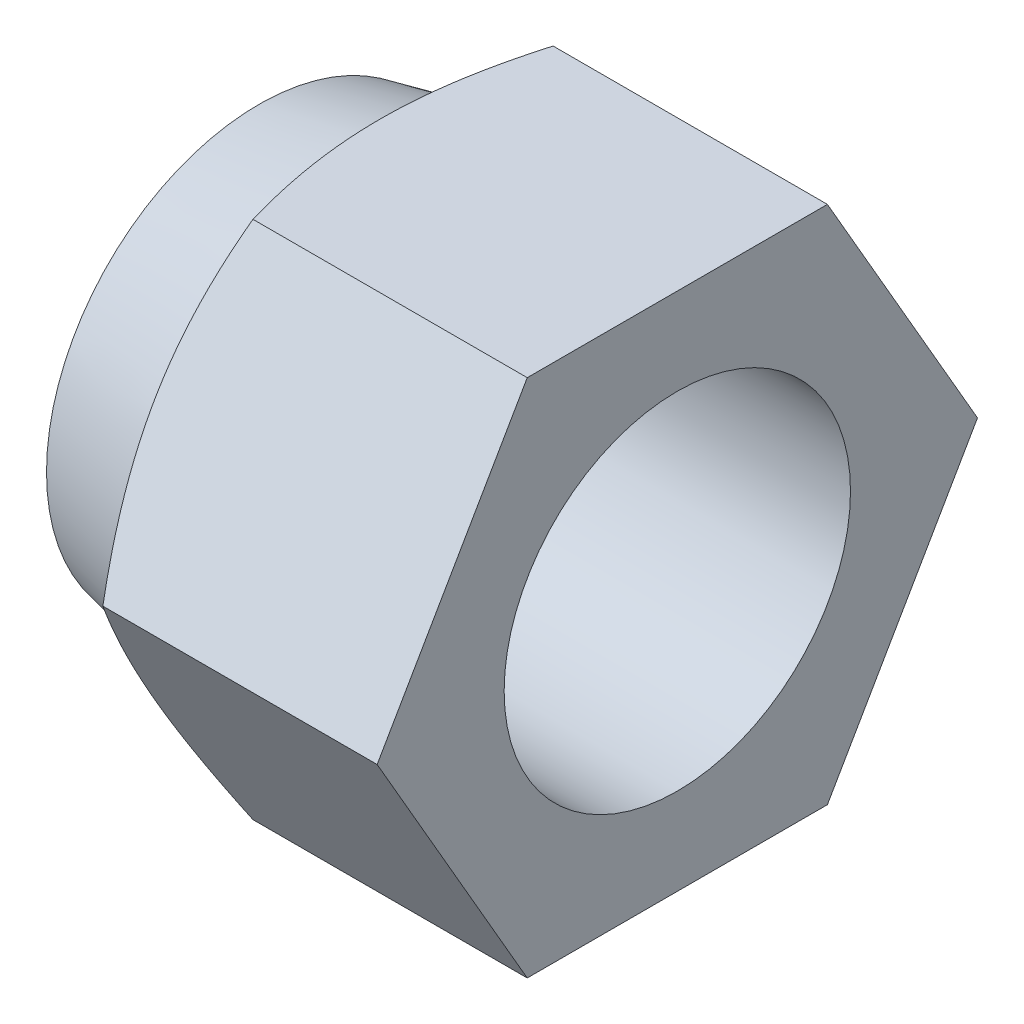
ISO-10303-21;
HEADER;
FILE_DESCRIPTION(('STEP AP214'),'2;1');
FILE_NAME('part.step','',(''),(''),'','','');
FILE_SCHEMA(('AUTOMOTIVE_DESIGN { 1 0 10303 214 1 1 1 1 }'));
ENDSEC;
DATA;
#1=APPLICATION_CONTEXT('core data for automotive mechanical design processes');
#2=APPLICATION_PROTOCOL_DEFINITION('international standard','automotive_design',2000,#1);
#3=PRODUCT_CONTEXT('',#1,'mechanical');
#4=PRODUCT('Part','Part','',(#3));
#5=PRODUCT_RELATED_PRODUCT_CATEGORY('part','',(#4));
#6=PRODUCT_DEFINITION_FORMATION('','',#4);
#7=PRODUCT_DEFINITION_CONTEXT('part definition',#1,'design');
#8=PRODUCT_DEFINITION('design','',#6,#7);
#9=PRODUCT_DEFINITION_SHAPE('','',#8);
#10=(LENGTH_UNIT() NAMED_UNIT(*) SI_UNIT(.MILLI.,.METRE.));
#11=(NAMED_UNIT(*) PLANE_ANGLE_UNIT() SI_UNIT($,.RADIAN.));
#12=(NAMED_UNIT(*) SI_UNIT($,.STERADIAN.) SOLID_ANGLE_UNIT());
#13=UNCERTAINTY_MEASURE_WITH_UNIT(LENGTH_MEASURE(1.E-05),#10,'distance_accuracy_value','');
#14=(GEOMETRIC_REPRESENTATION_CONTEXT(3) GLOBAL_UNCERTAINTY_ASSIGNED_CONTEXT((#13)) GLOBAL_UNIT_ASSIGNED_CONTEXT((#10,
#11,#12)) REPRESENTATION_CONTEXT('',''));
#15=CARTESIAN_POINT('',(0.,0.,0.));
#16=DIRECTION('',(0.,0.,1.));
#17=DIRECTION('',(1.,0.,0.));
#18=AXIS2_PLACEMENT_3D('',#15,#16,#17);
#19=CARTESIAN_POINT('',(-7.5438,0.,0.));
#20=DIRECTION('',(1.,0.,0.));
#21=DIRECTION('',(0.,0.,-1.));
#22=AXIS2_PLACEMENT_3D('',#19,#20,#21);
#23=CONICAL_SURFACE('',#22,8.255,1.0471975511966);
#24=CARTESIAN_POINT('',(-8.5598,0.,0.));
#25=DIRECTION('',(-1.,0.,0.));
#26=DIRECTION('',(0.,0.,1.));
#27=AXIS2_PLACEMENT_3D('',#24,#25,#26);
#28=CIRCLE('',#27,6.49523637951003);
#29=CARTESIAN_POINT('',(-8.5598,0.,6.49523637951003));
#30=VERTEX_POINT('',#29);
#31=EDGE_CURVE('E482',#30,#30,#28,.T.);
#32=ORIENTED_EDGE('',*,*,#31,.F.);
#33=EDGE_LOOP('',(#32));
#34=FACE_BOUND('',#33,.T.);
#35=CARTESIAN_POINT('',(-4.78656867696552,7.14903970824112,-10.8944690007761));
#36=CARTESIAN_POINT('',(-4.93784161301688,7.14903970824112,-10.5809890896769));
#37=CARTESIAN_POINT('',(-5.08759466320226,7.14903970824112,-10.2667620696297));
#38=CARTESIAN_POINT('',(-5.38319123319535,7.14903970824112,-9.63640957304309));
#39=CARTESIAN_POINT('',(-5.52903406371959,7.14903970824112,-9.32028377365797));
#40=CARTESIAN_POINT('',(-5.81672020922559,7.14903970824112,-8.68399579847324));
#41=CARTESIAN_POINT('',(-5.9585353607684,7.14903970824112,-8.36382084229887));
#42=CARTESIAN_POINT('',(-6.23599857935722,7.14903970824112,-7.72082002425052));
#43=CARTESIAN_POINT('',(-6.37164697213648,7.14903970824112,-7.39799430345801));
#44=CARTESIAN_POINT('',(-6.63664516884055,7.14903970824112,-6.74541517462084));
#45=CARTESIAN_POINT('',(-6.765904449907,7.14903970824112,-6.41562479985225));
#46=CARTESIAN_POINT('',(-7.01416839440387,7.14903970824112,-5.7521365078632));
#47=CARTESIAN_POINT('',(-7.13317191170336,7.14903970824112,-5.41843815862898));
#48=CARTESIAN_POINT('',(-7.35768798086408,7.14903970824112,-4.74730192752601));
#49=CARTESIAN_POINT('',(-7.46322967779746,7.14903970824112,-4.4098739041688));
#50=CARTESIAN_POINT('',(-7.65736259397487,7.14903970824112,-3.73023580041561));
#51=CARTESIAN_POINT('',(-7.74595922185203,7.14903970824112,-3.38802728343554));
#52=CARTESIAN_POINT('',(-7.90186579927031,7.14903970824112,-2.69851637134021));
#53=CARTESIAN_POINT('',(-7.96916730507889,7.14903970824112,-2.35121201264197));
#54=CARTESIAN_POINT('',(-8.05074860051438,7.14903970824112,-1.82724447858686));
#55=CARTESIAN_POINT('',(-8.07471561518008,7.14903970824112,-1.65206522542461));
#56=CARTESIAN_POINT('',(-8.1157203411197,7.14903970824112,-1.30090312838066));
#57=CARTESIAN_POINT('',(-8.13275870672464,7.14903970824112,-1.12492036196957));
#58=CARTESIAN_POINT('',(-8.15945000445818,7.14903970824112,-0.77347593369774));
#59=CARTESIAN_POINT('',(-8.16914746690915,7.14903970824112,-0.598017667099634));
#60=CARTESIAN_POINT('',(-8.1811065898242,7.14903970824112,-0.246848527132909));
#61=CARTESIAN_POINT('',(-8.1833683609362,7.14903970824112,-0.0711376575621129));
#62=CARTESIAN_POINT('',(-8.18040242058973,7.14903970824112,0.280173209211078));
#63=CARTESIAN_POINT('',(-8.17517676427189,7.14903970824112,0.455773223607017));
#64=CARTESIAN_POINT('',(-8.15736437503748,7.14903970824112,0.806602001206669));
#65=CARTESIAN_POINT('',(-8.14477724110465,7.14903970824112,0.981830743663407));
#66=CARTESIAN_POINT('',(-8.10546401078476,7.14903970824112,1.40809367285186));
#67=CARTESIAN_POINT('',(-8.07496272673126,7.14903970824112,1.65878631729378));
#68=CARTESIAN_POINT('',(-8.00060359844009,7.14903970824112,2.15817235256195));
#69=CARTESIAN_POINT('',(-7.95674372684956,7.14903970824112,2.40686543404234));
#70=CARTESIAN_POINT('',(-7.80733010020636,7.14903970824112,3.15039666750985));
#71=CARTESIAN_POINT('',(-7.68404370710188,7.14903970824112,3.64171081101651));
#72=CARTESIAN_POINT('',(-7.47190643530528,7.14903970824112,4.37653162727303));
#73=CARTESIAN_POINT('',(-7.39563921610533,7.14903970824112,4.62388853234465));
#74=CARTESIAN_POINT('',(-7.23560965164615,7.14903970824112,5.1162127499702));
#75=CARTESIAN_POINT('',(-7.15184663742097,7.14903970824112,5.3611798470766));
#76=CARTESIAN_POINT('',(-6.97861204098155,7.14903970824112,5.84750046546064));
#77=CARTESIAN_POINT('',(-6.88917550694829,7.14903970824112,6.08886659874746));
#78=CARTESIAN_POINT('',(-6.70519359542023,7.14903970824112,6.56955260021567));
#79=CARTESIAN_POINT('',(-6.61064998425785,7.14903970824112,6.80887314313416));
#80=CARTESIAN_POINT('',(-6.51403257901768,7.14903970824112,7.04733366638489));
#81=B_SPLINE_CURVE_WITH_KNOTS('',3,(#35,#36,#37,#38,#39,#40,#41,#42,#43,#44,#45,#46,#47,#48,#49,
#50,#51,#52,#53,#54,#55,#56,#57,#58,#59,#60,#61,#62,#63,#64,#65,#66,#67,#68,#69,#70,#71,#72,#73,
#74,#75,#76,#77,#78,#79,#80),.UNSPECIFIED.,.F.,.F.,(4,2,2,2,2,2,2,2,2,2,2,2,2,2,2,2,2,2,2,2,2,2,
4),(0.,1.04422615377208,2.08863518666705,3.13911281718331,4.18953489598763,5.25205350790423,
6.31469070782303,7.37498675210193,8.43494379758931,9.49532060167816,10.0256385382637,
10.5559063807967,11.0829312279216,11.6099482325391,12.1368206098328,12.663721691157,
13.4209143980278,14.1782220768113,15.695768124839,16.4722523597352,17.2488059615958,
18.0209579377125,18.7928445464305),.UNSPECIFIED.);
#82=CARTESIAN_POINT('',(-7.54379999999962,7.14903970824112,-4.12750000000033));
#83=VERTEX_POINT('',#82);
#84=CARTESIAN_POINT('',(-7.5438,7.14903970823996,4.127500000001));
#85=VERTEX_POINT('',#84);
#86=EDGE_CURVE('E12',#83,#85,#81,.T.);
#87=ORIENTED_EDGE('',*,*,#86,.F.);
#88=CARTESIAN_POINT('',(-7.54373333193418,-0.00019999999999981,-8.2551154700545));
#89=CARTESIAN_POINT('',(-7.59610673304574,0.156943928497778,-8.1643883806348));
#90=CARTESIAN_POINT('',(-7.64610322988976,0.314673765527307,-8.07332301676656));
#91=CARTESIAN_POINT('',(-7.74068776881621,0.631414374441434,-7.8904527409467));
#92=CARTESIAN_POINT('',(-7.78527347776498,0.790425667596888,-7.79864752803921));
#93=CARTESIAN_POINT('',(-7.91003927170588,1.27000550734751,-7.52176197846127));
#94=CARTESIAN_POINT('',(-7.98100462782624,1.5924671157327,-7.33558868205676));
#95=CARTESIAN_POINT('',(-8.0642198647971,2.07502504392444,-7.05698373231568));
#96=CARTESIAN_POINT('',(-8.08792547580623,2.23367953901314,-6.96538451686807));
#97=CARTESIAN_POINT('',(-8.12767632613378,2.5517054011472,-6.78177219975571));
#98=CARTESIAN_POINT('',(-8.14372224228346,2.71107670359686,-6.68975913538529));
#99=CARTESIAN_POINT('',(-8.16774476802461,3.03009609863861,-6.50557320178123));
#100=CARTESIAN_POINT('',(-8.17573053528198,3.1897436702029,-6.41340063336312));
#101=CARTESIAN_POINT('',(-8.18347009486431,3.50917746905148,-6.22897544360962));
#102=CARTESIAN_POINT('',(-8.18322414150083,3.66896369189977,-6.13672282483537));
#103=CARTESIAN_POINT('',(-8.17123534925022,4.10672450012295,-5.88398150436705));
#104=CARTESIAN_POINT('',(-8.15110974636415,4.38455578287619,-5.72357553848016));
#105=CARTESIAN_POINT('',(-8.08729164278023,4.93837301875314,-5.40382900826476));
#106=CARTESIAN_POINT('',(-8.04357733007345,5.21435702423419,-5.24448956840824));
#107=CARTESIAN_POINT('',(-7.93430437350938,5.76928878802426,-4.92409956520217));
#108=CARTESIAN_POINT('',(-7.86828275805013,6.04816652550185,-4.76308942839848));
#109=CARTESIAN_POINT('',(-7.71844038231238,6.6017631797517,-4.44347025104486));
#110=CARTESIAN_POINT('',(-7.6346548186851,6.87648918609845,-4.28485711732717));
#111=CARTESIAN_POINT('',(-7.54373333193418,7.14923970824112,-4.12738452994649));
#112=B_SPLINE_CURVE_WITH_KNOTS('',3,(#88,#89,#90,#91,#92,#93,#94,#95,#96,#97,#98,#99,#100,#101,
#102,#103,#104,#105,#106,#107,#108,#109,#110,#111),.UNSPECIFIED.,.F.,.F.,(4,2,2,2,2,2,2,2,2,2,2,
4),(0.,0.566538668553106,1.13332076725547,2.26924008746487,2.82328813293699,3.37728721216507,
3.93065614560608,4.48400798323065,5.44732494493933,6.41153419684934,7.3971281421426,
8.3807872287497),.UNSPECIFIED.);
#113=CARTESIAN_POINT('',(-7.54379999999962,0.,-8.25500000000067));
#114=VERTEX_POINT('',#113);
#115=EDGE_CURVE('E397',#114,#83,#112,.T.);
#116=ORIENTED_EDGE('',*,*,#115,.F.);
#117=CARTESIAN_POINT('',(-7.54373333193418,-7.14923970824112,-4.12738452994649));
#118=CARTESIAN_POINT('',(-7.59610673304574,-6.99209577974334,-4.2181116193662));
#119=CARTESIAN_POINT('',(-7.64610322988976,-6.83436594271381,-4.30917698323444));
#120=CARTESIAN_POINT('',(-7.74068776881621,-6.51762533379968,-4.49204725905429));
#121=CARTESIAN_POINT('',(-7.78527347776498,-6.35861404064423,-4.58385247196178));
#122=CARTESIAN_POINT('',(-7.91003927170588,-5.8790342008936,-4.86073802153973));
#123=CARTESIAN_POINT('',(-7.98100462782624,-5.55657259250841,-5.04691131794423));
#124=CARTESIAN_POINT('',(-8.0642198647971,-5.07401466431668,-5.32551626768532));
#125=CARTESIAN_POINT('',(-8.08792547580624,-4.91536016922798,-5.41711548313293));
#126=CARTESIAN_POINT('',(-8.12767632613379,-4.59733430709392,-5.60072780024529));
#127=CARTESIAN_POINT('',(-8.14372224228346,-4.43796300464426,-5.6927408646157));
#128=CARTESIAN_POINT('',(-8.16774476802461,-4.1189436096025,-5.87692679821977));
#129=CARTESIAN_POINT('',(-8.17573053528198,-3.95929603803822,-5.96909936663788));
#130=CARTESIAN_POINT('',(-8.18347009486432,-3.63986223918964,-6.15352455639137));
#131=CARTESIAN_POINT('',(-8.18322414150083,-3.48007601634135,-6.24577717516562));
#132=CARTESIAN_POINT('',(-8.17123534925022,-3.04231520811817,-6.49851849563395));
#133=CARTESIAN_POINT('',(-8.15110974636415,-2.76448392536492,-6.65892446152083));
#134=CARTESIAN_POINT('',(-8.08729164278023,-2.21066668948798,-6.97867099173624));
#135=CARTESIAN_POINT('',(-8.04357733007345,-1.93468268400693,-7.13801043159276));
#136=CARTESIAN_POINT('',(-7.93430437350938,-1.37975092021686,-7.45840043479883));
#137=CARTESIAN_POINT('',(-7.86828275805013,-1.10087318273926,-7.61941057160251));
#138=CARTESIAN_POINT('',(-7.71844038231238,-0.547276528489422,-7.93902974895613));
#139=CARTESIAN_POINT('',(-7.6346548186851,-0.272550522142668,-8.09764288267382));
#140=CARTESIAN_POINT('',(-7.54373333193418,0.000199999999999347,-8.2551154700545));
#141=B_SPLINE_CURVE_WITH_KNOTS('',3,(#117,#118,#119,#120,#121,#122,#123,#124,#125,#126,#127,
#128,#129,#130,#131,#132,#133,#134,#135,#136,#137,#138,#139,#140),.UNSPECIFIED.,.F.,.F.,(4,2,2,
2,2,2,2,2,2,2,2,4),(0.,0.566538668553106,1.13332076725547,2.26924008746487,2.82328813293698,
3.37728721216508,3.93065614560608,4.48400798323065,5.44732494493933,6.41153419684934,
7.3971281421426,8.3807872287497),.UNSPECIFIED.);
#142=CARTESIAN_POINT('',(-7.54379999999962,-7.14903970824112,-4.12750000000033));
#143=VERTEX_POINT('',#142);
#144=EDGE_CURVE('E532',#143,#114,#141,.T.);
#145=ORIENTED_EDGE('',*,*,#144,.F.);
#146=CARTESIAN_POINT('',(-4.78656867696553,-7.14903970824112,-10.8944690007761));
#147=CARTESIAN_POINT('',(-4.93784161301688,-7.14903970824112,-10.5809890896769));
#148=CARTESIAN_POINT('',(-5.08759466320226,-7.14903970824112,-10.2667620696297));
#149=CARTESIAN_POINT('',(-5.38319123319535,-7.14903970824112,-9.6364095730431));
#150=CARTESIAN_POINT('',(-5.52903406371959,-7.14903970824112,-9.32028377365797));
#151=CARTESIAN_POINT('',(-5.81672020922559,-7.14903970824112,-8.68399579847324));
#152=CARTESIAN_POINT('',(-5.9585353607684,-7.14903970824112,-8.36382084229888));
#153=CARTESIAN_POINT('',(-6.23599857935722,-7.14903970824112,-7.72082002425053));
#154=CARTESIAN_POINT('',(-6.37164697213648,-7.14903970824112,-7.39799430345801));
#155=CARTESIAN_POINT('',(-6.63664516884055,-7.14903970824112,-6.74541517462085));
#156=CARTESIAN_POINT('',(-6.765904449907,-7.14903970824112,-6.41562479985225));
#157=CARTESIAN_POINT('',(-7.01416839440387,-7.14903970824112,-5.7521365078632));
#158=CARTESIAN_POINT('',(-7.13317191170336,-7.14903970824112,-5.41843815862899));
#159=CARTESIAN_POINT('',(-7.35768798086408,-7.14903970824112,-4.74730192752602));
#160=CARTESIAN_POINT('',(-7.46322967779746,-7.14903970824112,-4.40987390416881));
#161=CARTESIAN_POINT('',(-7.65736259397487,-7.14903970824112,-3.73023580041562));
#162=CARTESIAN_POINT('',(-7.74595922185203,-7.14903970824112,-3.38802728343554));
#163=CARTESIAN_POINT('',(-7.90186579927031,-7.14903970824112,-2.69851637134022));
#164=CARTESIAN_POINT('',(-7.96916730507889,-7.14903970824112,-2.35121201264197));
#165=CARTESIAN_POINT('',(-8.05074860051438,-7.14903970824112,-1.82724447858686));
#166=CARTESIAN_POINT('',(-8.07471561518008,-7.14903970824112,-1.65206522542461));
#167=CARTESIAN_POINT('',(-8.1157203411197,-7.14903970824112,-1.30090312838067));
#168=CARTESIAN_POINT('',(-8.13275870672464,-7.14903970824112,-1.12492036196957));
#169=CARTESIAN_POINT('',(-8.15945000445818,-7.14903970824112,-0.773475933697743));
#170=CARTESIAN_POINT('',(-8.16914746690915,-7.14903970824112,-0.598017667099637));
#171=CARTESIAN_POINT('',(-8.18110658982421,-7.14903970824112,-0.246848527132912));
#172=CARTESIAN_POINT('',(-8.1833683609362,-7.14903970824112,-0.071137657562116));
#173=CARTESIAN_POINT('',(-8.18040242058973,-7.14903970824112,0.280173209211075));
#174=CARTESIAN_POINT('',(-8.17517676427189,-7.14903970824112,0.455773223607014));
#175=CARTESIAN_POINT('',(-8.15736437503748,-7.14903970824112,0.806602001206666));
#176=CARTESIAN_POINT('',(-8.14477724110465,-7.14903970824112,0.981830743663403));
#177=CARTESIAN_POINT('',(-8.10546401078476,-7.14903970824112,1.40809367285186));
#178=CARTESIAN_POINT('',(-8.07496272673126,-7.14903970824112,1.65878631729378));
#179=CARTESIAN_POINT('',(-8.00060359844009,-7.14903970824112,2.15817235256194));
#180=CARTESIAN_POINT('',(-7.95674372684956,-7.14903970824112,2.40686543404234));
#181=CARTESIAN_POINT('',(-7.80733010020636,-7.14903970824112,3.15039666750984));
#182=CARTESIAN_POINT('',(-7.68404370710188,-7.14903970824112,3.6417108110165));
#183=CARTESIAN_POINT('',(-7.47190643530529,-7.14903970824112,4.37653162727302));
#184=CARTESIAN_POINT('',(-7.39563921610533,-7.14903970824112,4.62388853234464));
#185=CARTESIAN_POINT('',(-7.23560965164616,-7.14903970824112,5.11621274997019));
#186=CARTESIAN_POINT('',(-7.15184663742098,-7.14903970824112,5.36117984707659));
#187=CARTESIAN_POINT('',(-6.97861204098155,-7.14903970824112,5.84750046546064));
#188=CARTESIAN_POINT('',(-6.88917550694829,-7.14903970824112,6.08886659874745));
#189=CARTESIAN_POINT('',(-6.70519359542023,-7.14903970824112,6.56955260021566));
#190=CARTESIAN_POINT('',(-6.61064998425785,-7.14903970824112,6.80887314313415));
#191=CARTESIAN_POINT('',(-6.51403257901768,-7.14903970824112,7.04733366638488));
#192=B_SPLINE_CURVE_WITH_KNOTS('',3,(#146,#147,#148,#149,#150,#151,#152,#153,#154,#155,#156,
#157,#158,#159,#160,#161,#162,#163,#164,#165,#166,#167,#168,#169,#170,#171,#172,#173,#174,#175,
#176,#177,#178,#179,#180,#181,#182,#183,#184,#185,#186,#187,#188,#189,#190,#191),.UNSPECIFIED.,
.F.,.F.,(4,2,2,2,2,2,2,2,2,2,2,2,2,2,2,2,2,2,2,2,2,2,4),(0.,1.04422615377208,2.08863518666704,
3.1391128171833,4.18953489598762,5.25205350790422,6.31469070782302,7.37498675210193,
8.43494379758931,9.49532060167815,10.0256385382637,10.5559063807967,11.0829312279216,
11.6099482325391,12.1368206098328,12.663721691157,13.4209143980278,14.1782220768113,
15.695768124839,16.4722523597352,17.2488059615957,18.0209579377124,18.7928445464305),.UNSPECIFIED.);
#193=CARTESIAN_POINT('',(-7.54379999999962,-7.14903970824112,4.12750000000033));
#194=VERTEX_POINT('',#193);
#195=EDGE_CURVE('E533',#194,#143,#192,.F.);
#196=ORIENTED_EDGE('',*,*,#195,.F.);
#197=CARTESIAN_POINT('',(-7.54373333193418,0.000199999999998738,8.2551154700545));
#198=CARTESIAN_POINT('',(-7.59610673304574,-0.156943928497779,8.1643883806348));
#199=CARTESIAN_POINT('',(-7.64610322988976,-0.314673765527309,8.07332301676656));
#200=CARTESIAN_POINT('',(-7.74068776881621,-0.631414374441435,7.8904527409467));
#201=CARTESIAN_POINT('',(-7.78527347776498,-0.79042566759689,7.79864752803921));
#202=CARTESIAN_POINT('',(-7.91003927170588,-1.27000550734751,7.52176197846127));
#203=CARTESIAN_POINT('',(-7.98100462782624,-1.5924671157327,7.33558868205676));
#204=CARTESIAN_POINT('',(-8.0642198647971,-2.07502504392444,7.05698373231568));
#205=CARTESIAN_POINT('',(-8.08792547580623,-2.23367953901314,6.96538451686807));
#206=CARTESIAN_POINT('',(-8.12767632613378,-2.5517054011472,6.78177219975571));
#207=CARTESIAN_POINT('',(-8.14372224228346,-2.71107670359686,6.68975913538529));
#208=CARTESIAN_POINT('',(-8.16774476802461,-3.03009609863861,6.50557320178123));
#209=CARTESIAN_POINT('',(-8.17573053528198,-3.1897436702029,6.41340063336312));
#210=CARTESIAN_POINT('',(-8.18347009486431,-3.50917746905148,6.22897544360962));
#211=CARTESIAN_POINT('',(-8.18322414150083,-3.66896369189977,6.13672282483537));
#212=CARTESIAN_POINT('',(-8.17123534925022,-4.10672450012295,5.88398150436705));
#213=CARTESIAN_POINT('',(-8.15110974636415,-4.38455578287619,5.72357553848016));
#214=CARTESIAN_POINT('',(-8.08729164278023,-4.93837301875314,5.40382900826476));
#215=CARTESIAN_POINT('',(-8.04357733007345,-5.21435702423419,5.24448956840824));
#216=CARTESIAN_POINT('',(-7.93430437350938,-5.76928878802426,4.92409956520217));
#217=CARTESIAN_POINT('',(-7.86828275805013,-6.04816652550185,4.76308942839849));
#218=CARTESIAN_POINT('',(-7.71844038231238,-6.60176317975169,4.44347025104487));
#219=CARTESIAN_POINT('',(-7.6346548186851,-6.87648918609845,4.28485711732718));
#220=CARTESIAN_POINT('',(-7.54373333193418,-7.14923970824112,4.1273845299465));
#221=B_SPLINE_CURVE_WITH_KNOTS('',3,(#197,#198,#199,#200,#201,#202,#203,#204,#205,#206,#207,
#208,#209,#210,#211,#212,#213,#214,#215,#216,#217,#218,#219,#220),.UNSPECIFIED.,.F.,.F.,(4,2,2,
2,2,2,2,2,2,2,2,4),(0.,0.566538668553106,1.13332076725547,2.26924008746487,2.82328813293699,
3.37728721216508,3.93065614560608,4.48400798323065,5.44732494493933,6.41153419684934,
7.3971281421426,8.3807872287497),.UNSPECIFIED.);
#222=CARTESIAN_POINT('',(-7.54379999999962,0.,8.25500000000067));
#223=VERTEX_POINT('',#222);
#224=EDGE_CURVE('E444',#223,#194,#221,.T.);
#225=ORIENTED_EDGE('',*,*,#224,.F.);
#226=CARTESIAN_POINT('',(-7.54373333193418,7.14923970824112,4.12738452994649));
#227=CARTESIAN_POINT('',(-7.59610673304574,6.99209577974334,4.2181116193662));
#228=CARTESIAN_POINT('',(-7.64610322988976,6.83436594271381,4.30917698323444));
#229=CARTESIAN_POINT('',(-7.74068776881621,6.51762533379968,4.49204725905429));
#230=CARTESIAN_POINT('',(-7.78527347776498,6.35861404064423,4.58385247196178));
#231=CARTESIAN_POINT('',(-7.91003927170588,5.8790342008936,4.86073802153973));
#232=CARTESIAN_POINT('',(-7.98100462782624,5.55657259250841,5.04691131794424));
#233=CARTESIAN_POINT('',(-8.0642198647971,5.07401466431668,5.32551626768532));
#234=CARTESIAN_POINT('',(-8.08792547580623,4.91536016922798,5.41711548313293));
#235=CARTESIAN_POINT('',(-8.12767632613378,4.59733430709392,5.60072780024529));
#236=CARTESIAN_POINT('',(-8.14372224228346,4.43796300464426,5.6927408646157));
#237=CARTESIAN_POINT('',(-8.16774476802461,4.1189436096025,5.87692679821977));
#238=CARTESIAN_POINT('',(-8.17573053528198,3.95929603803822,5.96909936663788));
#239=CARTESIAN_POINT('',(-8.18347009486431,3.63986223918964,6.15352455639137));
#240=CARTESIAN_POINT('',(-8.18322414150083,3.48007601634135,6.24577717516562));
#241=CARTESIAN_POINT('',(-8.17123534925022,3.04231520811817,6.49851849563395));
#242=CARTESIAN_POINT('',(-8.15110974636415,2.76448392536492,6.65892446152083));
#243=CARTESIAN_POINT('',(-8.08729164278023,2.21066668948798,6.97867099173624));
#244=CARTESIAN_POINT('',(-8.04357733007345,1.93468268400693,7.13801043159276));
#245=CARTESIAN_POINT('',(-7.93430437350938,1.37975092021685,7.45840043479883));
#246=CARTESIAN_POINT('',(-7.86828275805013,1.10087318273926,7.61941057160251));
#247=CARTESIAN_POINT('',(-7.71844038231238,0.547276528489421,7.93902974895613));
#248=CARTESIAN_POINT('',(-7.6346548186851,0.272550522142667,8.09764288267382));
#249=CARTESIAN_POINT('',(-7.54373333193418,-0.000200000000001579,8.2551154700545));
#250=B_SPLINE_CURVE_WITH_KNOTS('',3,(#226,#227,#228,#229,#230,#231,#232,#233,#234,#235,#236,
#237,#238,#239,#240,#241,#242,#243,#244,#245,#246,#247,#248,#249),.UNSPECIFIED.,.F.,.F.,(4,2,2,
2,2,2,2,2,2,2,2,4),(0.,0.566538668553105,1.13332076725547,2.26924008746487,2.82328813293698,
3.37728721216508,3.93065614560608,4.48400798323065,5.44732494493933,6.41153419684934,
7.3971281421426,8.3807872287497),.UNSPECIFIED.);
#251=EDGE_CURVE('E485',#85,#223,#250,.T.);
#252=ORIENTED_EDGE('',*,*,#251,.F.);
#253=EDGE_LOOP('',(#87,#116,#145,#196,#225,#252));
#254=FACE_BOUND('',#253,.T.);
#255=ADVANCED_FACE('F384',(#34,#254),#23,.T.);
#256=CARTESIAN_POINT('',(-11.5062,0.,0.));
#257=DIRECTION('',(1.,0.,0.));
#258=DIRECTION('',(0.,0.,-1.));
#259=AXIS2_PLACEMENT_3D('',#256,#257,#258);
#260=PLANE('',#259);
#261=CARTESIAN_POINT('',(-11.5062,0.,0.));
#262=DIRECTION('',(1.,0.,0.));
#263=DIRECTION('',(0.,0.,-1.));
#264=AXIS2_PLACEMENT_3D('',#261,#262,#263);
#265=CIRCLE('',#264,4.7625);
#266=CARTESIAN_POINT('',(-11.5062,0.,-4.7625));
#267=VERTEX_POINT('',#266);
#268=EDGE_CURVE('E556',#267,#267,#265,.T.);
#269=ORIENTED_EDGE('',*,*,#268,.T.);
#270=EDGE_LOOP('',(#269));
#271=FACE_BOUND('',#270,.T.);
#272=CARTESIAN_POINT('',(-11.5062,0.,0.));
#273=DIRECTION('',(-1.,0.,0.));
#274=DIRECTION('',(0.,0.,1.));
#275=AXIS2_PLACEMENT_3D('',#272,#273,#274);
#276=CIRCLE('',#275,5.842);
#277=CARTESIAN_POINT('',(-11.5062,0.,5.842));
#278=VERTEX_POINT('',#277);
#279=EDGE_CURVE('E474',#278,#278,#276,.T.);
#280=ORIENTED_EDGE('',*,*,#279,.T.);
#281=EDGE_LOOP('',(#280));
#282=FACE_BOUND('',#281,.T.);
#283=ADVANCED_FACE('F386',(#271,#282),#260,.F.);
#284=CARTESIAN_POINT('',(-8.5598,0.,0.));
#285=DIRECTION('',(1.,0.,0.));
#286=DIRECTION('',(0.,0.,-1.));
#287=AXIS2_PLACEMENT_3D('',#284,#285,#286);
#288=CONICAL_SURFACE('',#287,6.49523637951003,0.218177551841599);
#289=ORIENTED_EDGE('',*,*,#279,.F.);
#290=EDGE_LOOP('',(#289));
#291=FACE_BOUND('',#290,.T.);
#292=ORIENTED_EDGE('',*,*,#31,.T.);
#293=EDGE_LOOP('',(#292));
#294=FACE_BOUND('',#293,.T.);
#295=ADVANCED_FACE('F507',(#291,#294),#288,.T.);
#296=CARTESIAN_POINT('',(-11.5062,7.14903970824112,-4.12750000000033));
#297=DIRECTION('',(0.,1.,0.));
#298=DIRECTION('',(0.,0.,1.));
#299=AXIS2_PLACEMENT_3D('',#296,#297,#298);
#300=PLANE('',#299);
#301=ORIENTED_EDGE('',*,*,#86,.T.);
#302=DIRECTION('',(1.,0.,0.));
#303=VECTOR('',#302,1.);
#304=CARTESIAN_POINT('',(-11.5062,7.14903970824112,4.12750000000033));
#305=LINE('',#304,#303);
#306=CARTESIAN_POINT('',(0.,7.14903970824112,4.12750000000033));
#307=VERTEX_POINT('',#306);
#308=EDGE_CURVE('E412',#85,#307,#305,.T.);
#309=ORIENTED_EDGE('',*,*,#308,.T.);
#310=DIRECTION('',(0.,0.,1.));
#311=VECTOR('',#310,1.);
#312=CARTESIAN_POINT('',(0.,7.14903970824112,-4.12750000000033));
#313=LINE('',#312,#311);
#314=CARTESIAN_POINT('',(0.,7.14903970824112,-4.12750000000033));
#315=VERTEX_POINT('',#314);
#316=EDGE_CURVE('E464',#315,#307,#313,.T.);
#317=ORIENTED_EDGE('',*,*,#316,.F.);
#318=DIRECTION('',(1.,0.,0.));
#319=VECTOR('',#318,1.);
#320=CARTESIAN_POINT('',(-11.5062,7.14903970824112,-4.12750000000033));
#321=LINE('',#320,#319);
#322=EDGE_CURVE('E472',#83,#315,#321,.T.);
#323=ORIENTED_EDGE('',*,*,#322,.F.);
#324=EDGE_LOOP('',(#301,#309,#317,#323));
#325=FACE_BOUND('',#324,.T.);
#326=ADVANCED_FACE('F503',(#325),#300,.T.);
#327=CARTESIAN_POINT('',(-11.5062,0.,-8.25500000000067));
#328=DIRECTION('',(0.,0.5,-0.866025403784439));
#329=DIRECTION('',(0.,0.866025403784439,0.5));
#330=AXIS2_PLACEMENT_3D('',#327,#328,#329);
#331=PLANE('',#330);
#332=ORIENTED_EDGE('',*,*,#115,.T.);
#333=ORIENTED_EDGE('',*,*,#322,.T.);
#334=DIRECTION('',(0.,0.866025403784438,0.5));
#335=VECTOR('',#334,1.);
#336=CARTESIAN_POINT('',(0.,0.,-8.25500000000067));
#337=LINE('',#336,#335);
#338=CARTESIAN_POINT('',(0.,0.,-8.25500000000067));
#339=VERTEX_POINT('',#338);
#340=EDGE_CURVE('E469',#339,#315,#337,.T.);
#341=ORIENTED_EDGE('',*,*,#340,.F.);
#342=DIRECTION('',(1.,0.,0.));
#343=VECTOR('',#342,1.);
#344=CARTESIAN_POINT('',(-11.5062,0.,-8.25500000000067));
#345=LINE('',#344,#343);
#346=EDGE_CURVE('E475',#114,#339,#345,.T.);
#347=ORIENTED_EDGE('',*,*,#346,.F.);
#348=EDGE_LOOP('',(#332,#333,#341,#347));
#349=FACE_BOUND('',#348,.T.);
#350=ADVANCED_FACE('F506',(#349),#331,.T.);
#351=CARTESIAN_POINT('',(-11.5062,-7.14903970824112,-4.12750000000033));
#352=DIRECTION('',(0.,-0.5,-0.866025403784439));
#353=DIRECTION('',(0.,0.866025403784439,-0.5));
#354=AXIS2_PLACEMENT_3D('',#351,#352,#353);
#355=PLANE('',#354);
#356=ORIENTED_EDGE('',*,*,#144,.T.);
#357=ORIENTED_EDGE('',*,*,#346,.T.);
#358=DIRECTION('',(0.,0.866025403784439,-0.5));
#359=VECTOR('',#358,1.);
#360=CARTESIAN_POINT('',(0.,-7.14903970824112,-4.12750000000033));
#361=LINE('',#360,#359);
#362=CARTESIAN_POINT('',(0.,-7.14903970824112,-4.12750000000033));
#363=VERTEX_POINT('',#362);
#364=EDGE_CURVE('E457',#363,#339,#361,.T.);
#365=ORIENTED_EDGE('',*,*,#364,.F.);
#366=DIRECTION('',(1.,0.,0.));
#367=VECTOR('',#366,1.);
#368=CARTESIAN_POINT('',(-11.5062,-7.14903970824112,-4.12750000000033));
#369=LINE('',#368,#367);
#370=EDGE_CURVE('E447',#143,#363,#369,.T.);
#371=ORIENTED_EDGE('',*,*,#370,.F.);
#372=EDGE_LOOP('',(#356,#357,#365,#371));
#373=FACE_BOUND('',#372,.T.);
#374=ADVANCED_FACE('F546',(#373),#355,.T.);
#375=CARTESIAN_POINT('',(-11.5062,-7.14903970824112,4.12750000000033));
#376=DIRECTION('',(0.,-1.,0.));
#377=DIRECTION('',(0.,0.,-1.));
#378=AXIS2_PLACEMENT_3D('',#375,#376,#377);
#379=PLANE('',#378);
#380=ORIENTED_EDGE('',*,*,#195,.T.);
#381=ORIENTED_EDGE('',*,*,#370,.T.);
#382=DIRECTION('',(0.,0.,-1.));
#383=VECTOR('',#382,1.);
#384=CARTESIAN_POINT('',(0.,-7.14903970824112,4.12750000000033));
#385=LINE('',#384,#383);
#386=CARTESIAN_POINT('',(0.,-7.14903970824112,4.12750000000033));
#387=VERTEX_POINT('',#386);
#388=EDGE_CURVE('E451',#387,#363,#385,.T.);
#389=ORIENTED_EDGE('',*,*,#388,.F.);
#390=DIRECTION('',(1.,0.,0.));
#391=VECTOR('',#390,1.);
#392=CARTESIAN_POINT('',(-11.5062,-7.14903970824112,4.12750000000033));
#393=LINE('',#392,#391);
#394=EDGE_CURVE('E440',#194,#387,#393,.T.);
#395=ORIENTED_EDGE('',*,*,#394,.F.);
#396=EDGE_LOOP('',(#380,#381,#389,#395));
#397=FACE_BOUND('',#396,.T.);
#398=ADVANCED_FACE('F452',(#397),#379,.T.);
#399=CARTESIAN_POINT('',(-11.5062,0.,8.25500000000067));
#400=DIRECTION('',(0.,-0.5,0.866025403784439));
#401=DIRECTION('',(0.,-0.866025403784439,-0.5));
#402=AXIS2_PLACEMENT_3D('',#399,#400,#401);
#403=PLANE('',#402);
#404=ORIENTED_EDGE('',*,*,#224,.T.);
#405=ORIENTED_EDGE('',*,*,#394,.T.);
#406=DIRECTION('',(0.,-0.866025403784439,-0.5));
#407=VECTOR('',#406,1.);
#408=CARTESIAN_POINT('',(0.,0.,8.25500000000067));
#409=LINE('',#408,#407);
#410=CARTESIAN_POINT('',(0.,0.,8.255));
#411=VERTEX_POINT('',#410);
#412=EDGE_CURVE('E404',#411,#387,#409,.T.);
#413=ORIENTED_EDGE('',*,*,#412,.F.);
#414=DIRECTION('',(1.,0.,0.));
#415=VECTOR('',#414,1.);
#416=CARTESIAN_POINT('',(-11.5062,0.,8.25500000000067));
#417=LINE('',#416,#415);
#418=EDGE_CURVE('E448',#223,#411,#417,.T.);
#419=ORIENTED_EDGE('',*,*,#418,.F.);
#420=EDGE_LOOP('',(#404,#405,#413,#419));
#421=FACE_BOUND('',#420,.T.);
#422=ADVANCED_FACE('F442',(#421),#403,.T.);
#423=CARTESIAN_POINT('',(-11.5062,7.14903970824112,4.12750000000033));
#424=DIRECTION('',(0.,0.5,0.866025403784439));
#425=DIRECTION('',(0.,-0.866025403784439,0.5));
#426=AXIS2_PLACEMENT_3D('',#423,#424,#425);
#427=PLANE('',#426);
#428=ORIENTED_EDGE('',*,*,#251,.T.);
#429=ORIENTED_EDGE('',*,*,#418,.T.);
#430=DIRECTION('',(0.,-0.866025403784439,0.5));
#431=VECTOR('',#430,1.);
#432=CARTESIAN_POINT('',(0.,7.14903970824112,4.12750000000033));
#433=LINE('',#432,#431);
#434=EDGE_CURVE('E462',#307,#411,#433,.T.);
#435=ORIENTED_EDGE('',*,*,#434,.F.);
#436=ORIENTED_EDGE('',*,*,#308,.F.);
#437=EDGE_LOOP('',(#428,#429,#435,#436));
#438=FACE_BOUND('',#437,.T.);
#439=ADVANCED_FACE('F498',(#438),#427,.T.);
#440=CARTESIAN_POINT('',(0.,0.,0.));
#441=DIRECTION('',(-1.,0.,0.));
#442=DIRECTION('',(0.,0.,1.));
#443=AXIS2_PLACEMENT_3D('',#440,#441,#442);
#444=PLANE('',#443);
#445=CARTESIAN_POINT('',(0.,0.,0.));
#446=DIRECTION('',(1.,0.,0.));
#447=DIRECTION('',(0.,0.,-1.));
#448=AXIS2_PLACEMENT_3D('',#445,#446,#447);
#449=CIRCLE('',#448,4.7625);
#450=CARTESIAN_POINT('',(0.,0.,-4.7625));
#451=VERTEX_POINT('',#450);
#452=EDGE_CURVE('E558',#451,#451,#449,.T.);
#453=ORIENTED_EDGE('',*,*,#452,.F.);
#454=EDGE_LOOP('',(#453));
#455=FACE_BOUND('',#454,.T.);
#456=ORIENTED_EDGE('',*,*,#316,.T.);
#457=ORIENTED_EDGE('',*,*,#434,.T.);
#458=ORIENTED_EDGE('',*,*,#412,.T.);
#459=ORIENTED_EDGE('',*,*,#388,.T.);
#460=ORIENTED_EDGE('',*,*,#364,.T.);
#461=ORIENTED_EDGE('',*,*,#340,.T.);
#462=EDGE_LOOP('',(#456,#457,#458,#459,#460,#461));
#463=FACE_BOUND('',#462,.T.);
#464=ADVANCED_FACE('F461',(#455,#463),#444,.F.);
#465=CARTESIAN_POINT('',(-11.5062,0.,0.));
#466=DIRECTION('',(1.,0.,0.));
#467=DIRECTION('',(0.,0.,-1.));
#468=AXIS2_PLACEMENT_3D('',#465,#466,#467);
#469=CYLINDRICAL_SURFACE('',#468,4.7625);
#470=ORIENTED_EDGE('',*,*,#268,.F.);
#471=EDGE_LOOP('',(#470));
#472=FACE_BOUND('',#471,.T.);
#473=ORIENTED_EDGE('',*,*,#452,.T.);
#474=EDGE_LOOP('',(#473));
#475=FACE_BOUND('',#474,.T.);
#476=ADVANCED_FACE('F547',(#472,#475),#469,.F.);
#477=CLOSED_SHELL('',(#255,#283,#295,#326,#350,#374,#398,#422,#439,#464,#476));
#478=MANIFOLD_SOLID_BREP('B2',#477);
#479=ADVANCED_BREP_SHAPE_REPRESENTATION('',(#18,#478),#14);
#480=SHAPE_DEFINITION_REPRESENTATION(#9,#479);
ENDSEC;
END-ISO-10303-21;
